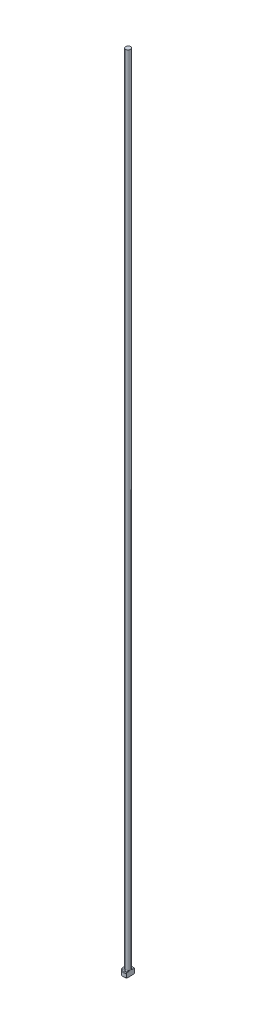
from build123d import *
from build123d.topology import SkipClean

# Parameters (mm, degrees)
CHAMFER1_SIZE = 0.2
FILLET1_R     = 0.2
KEY_DEPTH     = 251.008999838


with BuildPart() as part:
    # Sketch1 → Revolve1 (revolve)
    with BuildSketch(Plane.XY, mode=Mode.PRIVATE) as revolve1_sk:
        Polygon((0, 0), (-1.5, 0), (-1.5, 1.5), (-0.75, 1.5), (-0.75, 250), (0, 250), align=None)
    revolve(revolve1_sk.sketch.rotate(Axis((0, 259.958771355, 0), (0, -1, 0)), 270), axis=Axis((0, 259.958771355, 0), (0, -1, 0)))

    # Chamfer1
    chamfer1_edges = [part.edges().sort_by_distance(p)[0] for p in [
        (0, 1.5, -1.5),
        (0, 0, -1.5),
    ]]
    chamfer(chamfer1_edges, length=CHAMFER1_SIZE)

    # Fillet1
    fillet1_edges = [part.edges().sort_by_distance(p)[0] for p in [
        (0, 1.5, -0.75),
    ]]
    fillet(fillet1_edges, radius=FILLET1_R)

    # Sketch2 → KEY (cut, through all)
    with SkipClean():  # the faces are left unmerged after this step: merging them gives an invalid solid
        with BuildSketch(Plane(origin=(0, 0, 0), x_dir=(1, 0, 0), z_dir=(0, 1, 0))):
            with BuildLine():
                Line((0.75, 1.299038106), (0.75, -1.299038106))
                ThreePointArc((0.75, -1.299038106), (1.5, 0), (0.75, 1.299038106))
            make_face()
        extrude(amount=KEY_DEPTH, mode=Mode.SUBTRACT)


solid = part.part
